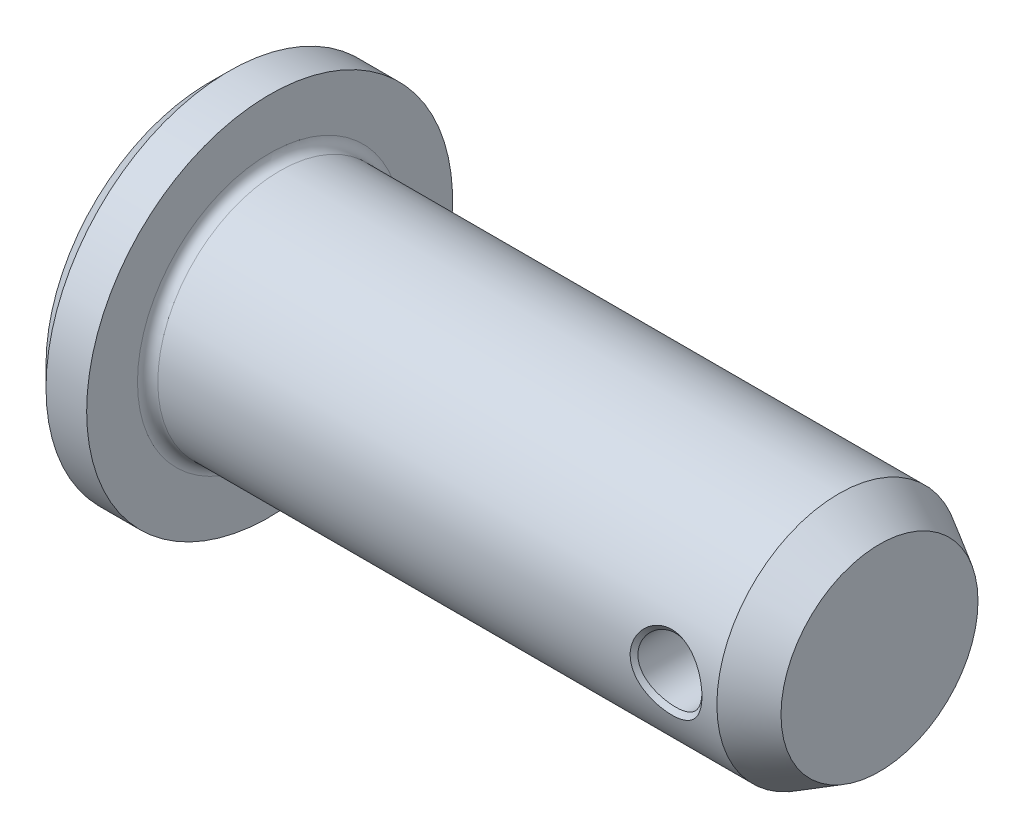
ISO-10303-21;
HEADER;
FILE_DESCRIPTION(('STEP AP214'),'2;1');
FILE_NAME('part.step','',(''),(''),'','','');
FILE_SCHEMA(('AUTOMOTIVE_DESIGN { 1 0 10303 214 1 1 1 1 }'));
ENDSEC;
DATA;
#1=APPLICATION_CONTEXT('core data for automotive mechanical design processes');
#2=APPLICATION_PROTOCOL_DEFINITION('international standard','automotive_design',2000,#1);
#3=PRODUCT_CONTEXT('',#1,'mechanical');
#4=PRODUCT('Part','Part','',(#3));
#5=PRODUCT_RELATED_PRODUCT_CATEGORY('part','',(#4));
#6=PRODUCT_DEFINITION_FORMATION('','',#4);
#7=PRODUCT_DEFINITION_CONTEXT('part definition',#1,'design');
#8=PRODUCT_DEFINITION('design','',#6,#7);
#9=PRODUCT_DEFINITION_SHAPE('','',#8);
#10=(LENGTH_UNIT() NAMED_UNIT(*) SI_UNIT(.MILLI.,.METRE.));
#11=(NAMED_UNIT(*) PLANE_ANGLE_UNIT() SI_UNIT($,.RADIAN.));
#12=(NAMED_UNIT(*) SI_UNIT($,.STERADIAN.) SOLID_ANGLE_UNIT());
#13=UNCERTAINTY_MEASURE_WITH_UNIT(LENGTH_MEASURE(1.E-05),#10,'distance_accuracy_value','');
#14=(GEOMETRIC_REPRESENTATION_CONTEXT(3) GLOBAL_UNCERTAINTY_ASSIGNED_CONTEXT((#13)) GLOBAL_UNIT_ASSIGNED_CONTEXT((#10,
#11,#12)) REPRESENTATION_CONTEXT('',''));
#15=CARTESIAN_POINT('',(0.,0.,0.));
#16=DIRECTION('',(0.,0.,1.));
#17=DIRECTION('',(1.,0.,0.));
#18=AXIS2_PLACEMENT_3D('',#15,#16,#17);
#19=CARTESIAN_POINT('',(0.,0.,0.));
#20=DIRECTION('',(-1.,0.,0.));
#21=DIRECTION('',(0.,0.,1.));
#22=AXIS2_PLACEMENT_3D('',#19,#20,#21);
#23=PLANE('',#22);
#24=CARTESIAN_POINT('',(0.,0.,0.));
#25=DIRECTION('',(-1.,0.,0.));
#26=DIRECTION('',(0.,0.,1.));
#27=AXIS2_PLACEMENT_3D('',#24,#25,#26);
#28=CIRCLE('',#27,16.);
#29=CARTESIAN_POINT('',(0.,0.,16.));
#30=VERTEX_POINT('',#29);
#31=EDGE_CURVE('E58',#30,#30,#28,.T.);
#32=ORIENTED_EDGE('',*,*,#31,.T.);
#33=EDGE_LOOP('',(#32));
#34=FACE_BOUND('',#33,.T.);
#35=ADVANCED_FACE('F31',(#34),#23,.T.);
#36=CARTESIAN_POINT('',(0.,0.,0.));
#37=DIRECTION('',(1.,0.,0.));
#38=DIRECTION('',(0.,0.,-1.));
#39=AXIS2_PLACEMENT_3D('',#36,#37,#38);
#40=CONICAL_SURFACE('',#39,16.,0.78539816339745);
#41=CARTESIAN_POINT('',(2.,0.,0.));
#42=DIRECTION('',(-1.,0.,0.));
#43=DIRECTION('',(0.,0.,1.));
#44=AXIS2_PLACEMENT_3D('',#41,#42,#43);
#45=CIRCLE('',#44,18.);
#46=CARTESIAN_POINT('',(2.,0.,18.));
#47=VERTEX_POINT('',#46);
#48=EDGE_CURVE('E63',#47,#47,#45,.T.);
#49=ORIENTED_EDGE('',*,*,#48,.T.);
#50=EDGE_LOOP('',(#49));
#51=FACE_BOUND('',#50,.T.);
#52=ORIENTED_EDGE('',*,*,#31,.F.);
#53=EDGE_LOOP('',(#52));
#54=FACE_BOUND('',#53,.T.);
#55=ADVANCED_FACE('F168',(#51,#54),#40,.T.);
#56=CARTESIAN_POINT('',(0.,0.,0.));
#57=DIRECTION('',(-1.,0.,0.));
#58=DIRECTION('',(0.,0.,1.));
#59=AXIS2_PLACEMENT_3D('',#56,#57,#58);
#60=CYLINDRICAL_SURFACE('',#59,18.);
#61=CARTESIAN_POINT('',(6.,0.,0.));
#62=DIRECTION('',(-1.,0.,0.));
#63=DIRECTION('',(0.,0.,1.));
#64=AXIS2_PLACEMENT_3D('',#61,#62,#63);
#65=CIRCLE('',#64,18.);
#66=CARTESIAN_POINT('',(6.,0.,18.));
#67=VERTEX_POINT('',#66);
#68=EDGE_CURVE('E68',#67,#67,#65,.T.);
#69=ORIENTED_EDGE('',*,*,#68,.T.);
#70=EDGE_LOOP('',(#69));
#71=FACE_BOUND('',#70,.T.);
#72=ORIENTED_EDGE('',*,*,#48,.F.);
#73=EDGE_LOOP('',(#72));
#74=FACE_BOUND('',#73,.T.);
#75=ADVANCED_FACE('F172',(#71,#74),#60,.T.);
#76=CARTESIAN_POINT('',(6.,18.,0.));
#77=DIRECTION('',(1.,0.,0.));
#78=DIRECTION('',(0.,0.,-1.));
#79=AXIS2_PLACEMENT_3D('',#76,#77,#78);
#80=PLANE('',#79);
#81=CARTESIAN_POINT('',(6.,0.,0.));
#82=DIRECTION('',(-1.,0.,0.));
#83=DIRECTION('',(0.,0.,1.));
#84=AXIS2_PLACEMENT_3D('',#81,#82,#83);
#85=CIRCLE('',#84,13.);
#86=CARTESIAN_POINT('',(6.,0.,13.));
#87=VERTEX_POINT('',#86);
#88=EDGE_CURVE('E190',#87,#87,#85,.T.);
#89=ORIENTED_EDGE('',*,*,#88,.T.);
#90=EDGE_LOOP('',(#89));
#91=FACE_BOUND('',#90,.T.);
#92=ORIENTED_EDGE('',*,*,#68,.F.);
#93=EDGE_LOOP('',(#92));
#94=FACE_BOUND('',#93,.T.);
#95=ADVANCED_FACE('F177',(#91,#94),#80,.T.);
#96=CARTESIAN_POINT('',(7.,0.,0.));
#97=DIRECTION('',(-1.,0.,0.));
#98=DIRECTION('',(0.,0.,1.));
#99=AXIS2_PLACEMENT_3D('',#96,#97,#98);
#100=TOROIDAL_SURFACE('',#99,13.,0.999999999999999);
#101=ORIENTED_EDGE('',*,*,#88,.F.);
#102=EDGE_LOOP('',(#101));
#103=FACE_BOUND('',#102,.T.);
#104=CARTESIAN_POINT('',(7.,0.,0.));
#105=DIRECTION('',(-1.,0.,0.));
#106=DIRECTION('',(0.,0.,1.));
#107=AXIS2_PLACEMENT_3D('',#104,#105,#106);
#108=CIRCLE('',#107,12.);
#109=CARTESIAN_POINT('',(7.,0.,12.));
#110=VERTEX_POINT('',#109);
#111=EDGE_CURVE('E193',#110,#110,#108,.T.);
#112=ORIENTED_EDGE('',*,*,#111,.T.);
#113=EDGE_LOOP('',(#112));
#114=FACE_BOUND('',#113,.T.);
#115=ADVANCED_FACE('F111',(#103,#114),#100,.F.);
#116=CARTESIAN_POINT('',(0.,0.,0.));
#117=DIRECTION('',(-1.,0.,0.));
#118=DIRECTION('',(0.,0.,1.));
#119=AXIS2_PLACEMENT_3D('',#116,#117,#118);
#120=CYLINDRICAL_SURFACE('',#119,12.);
#121=CARTESIAN_POINT('',(60.5309999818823,0.,12.));
#122=CARTESIAN_POINT('',(60.53059480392,0.963675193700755,11.9998958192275));
#123=CARTESIAN_POINT('',(60.1454326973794,1.90775318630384,11.8698914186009));
#124=CARTESIAN_POINT('',(58.8475713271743,3.25018331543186,11.5692999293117));
#125=CARTESIAN_POINT('',(57.9332355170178,3.64750594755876,11.432267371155));
#126=CARTESIAN_POINT('',(56.0681782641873,3.64606472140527,11.4326364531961));
#127=CARTESIAN_POINT('',(55.154420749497,3.25044613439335,11.5691885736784));
#128=CARTESIAN_POINT('',(53.8531985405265,1.90813389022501,11.8698611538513));
#129=CARTESIAN_POINT('',(53.4691044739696,0.964998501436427,11.9999888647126));
#130=CARTESIAN_POINT('',(53.4688955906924,-0.965652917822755,12.0000111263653));
#131=CARTESIAN_POINT('',(53.8524932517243,-1.90694169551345,11.8700886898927));
#132=CARTESIAN_POINT('',(55.1531008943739,-3.24954694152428,11.5694212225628));
#133=CARTESIAN_POINT('',(56.0691807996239,-3.64667685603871,11.4324385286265));
#134=CARTESIAN_POINT('',(57.9350177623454,-3.64689267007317,11.4324656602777));
#135=CARTESIAN_POINT('',(58.8467380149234,-3.25006313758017,11.5692062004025));
#136=CARTESIAN_POINT('',(60.1452542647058,-1.90891782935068,11.8697552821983));
#137=CARTESIAN_POINT('',(60.5314051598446,-0.963675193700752,12.0001041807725));
#138=CARTESIAN_POINT('',(60.5309999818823,0.,12.));
#139=B_SPLINE_CURVE_WITH_KNOTS('',3,(#121,#122,#123,#124,#125,#126,#127,#128,#129,#130,#131,
#132,#133,#134,#135,#136,#137,#138),.UNSPECIFIED.,.T.,.F.,(4,2,2,2,2,2,2,2,4),
(-0.0221963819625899,-0.0194195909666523,-0.0166427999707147,-0.0138660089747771,
-0.0110892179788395,-0.00831242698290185,-0.00553563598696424,-0.00275884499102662,
1.79460049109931E-05),.UNSPECIFIED.);
#140=CARTESIAN_POINT('',(60.5309999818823,0.,12.));
#141=VERTEX_POINT('',#140);
#142=EDGE_CURVE('E10',#141,#141,#139,.F.);
#143=ORIENTED_EDGE('',*,*,#142,.T.);
#144=EDGE_LOOP('',(#143));
#145=FACE_BOUND('',#144,.T.);
#146=CARTESIAN_POINT('',(60.5309999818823,0.,-12.));
#147=CARTESIAN_POINT('',(60.53059480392,-0.963675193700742,-11.9998958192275));
#148=CARTESIAN_POINT('',(60.1454326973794,-1.90775318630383,-11.8698914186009));
#149=CARTESIAN_POINT('',(58.8475713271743,-3.25018331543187,-11.5692999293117));
#150=CARTESIAN_POINT('',(57.9332355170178,-3.64750594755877,-11.432267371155));
#151=CARTESIAN_POINT('',(56.0681782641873,-3.64606472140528,-11.4326364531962));
#152=CARTESIAN_POINT('',(55.154420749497,-3.25044613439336,-11.5691885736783));
#153=CARTESIAN_POINT('',(53.8531985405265,-1.90813389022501,-11.8698611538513));
#154=CARTESIAN_POINT('',(53.4691044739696,-0.964998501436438,-11.9999888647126));
#155=CARTESIAN_POINT('',(53.4688955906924,0.965652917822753,-12.0000111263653));
#156=CARTESIAN_POINT('',(53.8524932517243,1.90694169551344,-11.8700886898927));
#157=CARTESIAN_POINT('',(55.1531008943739,3.24954694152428,-11.5694212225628));
#158=CARTESIAN_POINT('',(56.0691807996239,3.64667685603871,-11.4324385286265));
#159=CARTESIAN_POINT('',(57.9350177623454,3.64689267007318,-11.4324656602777));
#160=CARTESIAN_POINT('',(58.8467380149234,3.25006313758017,-11.5692062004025));
#161=CARTESIAN_POINT('',(60.1452542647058,1.90891782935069,-11.8697552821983));
#162=CARTESIAN_POINT('',(60.5314051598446,0.963675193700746,-12.0001041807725));
#163=CARTESIAN_POINT('',(60.5309999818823,0.,-12.));
#164=B_SPLINE_CURVE_WITH_KNOTS('',3,(#146,#147,#148,#149,#150,#151,#152,#153,#154,#155,#156,
#157,#158,#159,#160,#161,#162,#163),.UNSPECIFIED.,.T.,.F.,(4,2,2,2,2,2,2,2,4),
(-0.0221963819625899,-0.0194195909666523,-0.0166427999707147,-0.0138660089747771,
-0.0110892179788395,-0.00831242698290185,-0.00553563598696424,-0.00275884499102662,
1.79460049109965E-05),.UNSPECIFIED.);
#165=CARTESIAN_POINT('',(60.5309999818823,0.,-12.));
#166=VERTEX_POINT('',#165);
#167=EDGE_CURVE('E43',#166,#166,#164,.F.);
#168=ORIENTED_EDGE('',*,*,#167,.T.);
#169=EDGE_LOOP('',(#168));
#170=FACE_BOUND('',#169,.T.);
#171=CARTESIAN_POINT('',(62.,0.,0.));
#172=DIRECTION('',(-1.,0.,0.));
#173=DIRECTION('',(0.,0.,1.));
#174=AXIS2_PLACEMENT_3D('',#171,#172,#173);
#175=CIRCLE('',#174,12.);
#176=CARTESIAN_POINT('',(62.,0.,12.));
#177=VERTEX_POINT('',#176);
#178=EDGE_CURVE('E198',#177,#177,#175,.T.);
#179=ORIENTED_EDGE('',*,*,#178,.T.);
#180=EDGE_LOOP('',(#179));
#181=FACE_BOUND('',#180,.T.);
#182=ORIENTED_EDGE('',*,*,#111,.F.);
#183=EDGE_LOOP('',(#182));
#184=FACE_BOUND('',#183,.T.);
#185=ADVANCED_FACE('F101',(#145,#170,#181,#184),#120,.T.);
#186=CARTESIAN_POINT('',(62.,0.,0.));
#187=DIRECTION('',(-1.,0.,0.));
#188=DIRECTION('',(0.,0.,1.));
#189=AXIS2_PLACEMENT_3D('',#186,#187,#188);
#190=CONICAL_SURFACE('',#189,12.,0.5235987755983);
#191=CARTESIAN_POINT('',(66.,0.,0.));
#192=DIRECTION('',(-1.,0.,0.));
#193=DIRECTION('',(0.,0.,1.));
#194=AXIS2_PLACEMENT_3D('',#191,#192,#193);
#195=CIRCLE('',#194,9.69059892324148);
#196=CARTESIAN_POINT('',(66.,0.,9.69059892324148));
#197=VERTEX_POINT('',#196);
#198=EDGE_CURVE('E201',#197,#197,#195,.T.);
#199=ORIENTED_EDGE('',*,*,#198,.T.);
#200=EDGE_LOOP('',(#199));
#201=FACE_BOUND('',#200,.T.);
#202=ORIENTED_EDGE('',*,*,#178,.F.);
#203=EDGE_LOOP('',(#202));
#204=FACE_BOUND('',#203,.T.);
#205=ADVANCED_FACE('F110',(#201,#204),#190,.T.);
#206=CARTESIAN_POINT('',(66.,9.69059892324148,0.));
#207=DIRECTION('',(1.,0.,0.));
#208=DIRECTION('',(0.,0.,-1.));
#209=AXIS2_PLACEMENT_3D('',#206,#207,#208);
#210=PLANE('',#209);
#211=ORIENTED_EDGE('',*,*,#198,.F.);
#212=EDGE_LOOP('',(#211));
#213=FACE_BOUND('',#212,.T.);
#214=ADVANCED_FACE('F86',(#213),#210,.T.);
#215=CARTESIAN_POINT('',(57.,0.,-12.));
#216=DIRECTION('',(0.,0.,1.));
#217=DIRECTION('',(1.,0.,0.));
#218=AXIS2_PLACEMENT_3D('',#215,#216,#217);
#219=CYLINDRICAL_SURFACE('',#218,3.15);
#220=CARTESIAN_POINT('',(60.15,0.,11.6190000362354));
#221=CARTESIAN_POINT('',(60.1500240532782,-0.0519717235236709,11.6190069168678));
#222=CARTESIAN_POINT('',(60.1487009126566,-0.10394099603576,11.6185202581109));
#223=CARTESIAN_POINT('',(60.143410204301,-0.207646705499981,11.616610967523));
#224=CARTESIAN_POINT('',(60.13944676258,-0.259383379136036,11.6151897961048));
#225=CARTESIAN_POINT('',(60.128929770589,-0.362514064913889,11.611463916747));
#226=CARTESIAN_POINT('',(60.1223784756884,-0.413908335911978,11.6091599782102));
#227=CARTESIAN_POINT('',(60.1067417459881,-0.516246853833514,11.6037216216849));
#228=CARTESIAN_POINT('',(60.0976571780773,-0.56719124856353,11.6005874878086));
#229=CARTESIAN_POINT('',(60.0770088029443,-0.668522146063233,11.5935413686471));
#230=CARTESIAN_POINT('',(60.0654448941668,-0.718908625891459,11.5896293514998));
#231=CARTESIAN_POINT('',(60.0398924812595,-0.819016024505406,11.5810799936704));
#232=CARTESIAN_POINT('',(60.0259032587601,-0.868736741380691,11.5764424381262));
#233=CARTESIAN_POINT('',(59.9955544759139,-0.967404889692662,11.5664943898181));
#234=CARTESIAN_POINT('',(59.9791938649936,-1.01635196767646,11.5611835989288));
#235=CARTESIAN_POINT('',(59.9441562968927,-1.11336508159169,11.5499413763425));
#236=CARTESIAN_POINT('',(59.9254781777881,-1.16143066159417,11.5440096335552));
#237=CARTESIAN_POINT('',(59.8858593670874,-1.25657295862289,11.5315777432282));
#238=CARTESIAN_POINT('',(59.8649175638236,-1.30364917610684,11.5250773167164));
#239=CARTESIAN_POINT('',(59.8208250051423,-1.39670485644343,11.5115602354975));
#240=CARTESIAN_POINT('',(59.797673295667,-1.44268383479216,11.5045433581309));
#241=CARTESIAN_POINT('',(59.7492144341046,-1.53343708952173,11.4900456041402));
#242=CARTESIAN_POINT('',(59.7239065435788,-1.57821094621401,11.4825645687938));
#243=CARTESIAN_POINT('',(59.6711888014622,-1.66644591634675,11.4671904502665));
#244=CARTESIAN_POINT('',(59.6437784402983,-1.709906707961,11.4592972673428));
#245=CARTESIAN_POINT('',(59.5869091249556,-1.79540761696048,11.4431518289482));
#246=CARTESIAN_POINT('',(59.5574498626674,-1.83744751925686,11.4348995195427));
#247=CARTESIAN_POINT('',(59.496536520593,-1.91999816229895,11.4180850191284));
#248=CARTESIAN_POINT('',(59.4650822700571,-1.96050877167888,11.4095228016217));
#249=CARTESIAN_POINT('',(59.4002313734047,-2.03989440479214,11.3921518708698));
#250=CARTESIAN_POINT('',(59.3668345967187,-2.07876931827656,11.3833431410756));
#251=CARTESIAN_POINT('',(59.2981564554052,-2.15476958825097,11.3654896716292));
#252=CARTESIAN_POINT('',(59.2628748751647,-2.19189474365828,11.3564449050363));
#253=CARTESIAN_POINT('',(59.1904803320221,-2.26429503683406,11.3383311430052));
#254=CARTESIAN_POINT('',(59.1533676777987,-2.29957048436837,11.3292621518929));
#255=CARTESIAN_POINT('',(59.077414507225,-2.36822547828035,11.3113178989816));
#256=CARTESIAN_POINT('',(59.0385747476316,-2.4016058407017,11.3024425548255));
#257=CARTESIAN_POINT('',(58.9592768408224,-2.46641301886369,11.2849020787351));
#258=CARTESIAN_POINT('',(58.9188192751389,-2.4978405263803,11.2762368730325));
#259=CARTESIAN_POINT('',(58.8363897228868,-2.55869184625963,11.259186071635));
#260=CARTESIAN_POINT('',(58.7944182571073,-2.5881163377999,11.2508003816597));
#261=CARTESIAN_POINT('',(58.709066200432,-2.64490931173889,11.2343638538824));
#262=CARTESIAN_POINT('',(58.6656861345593,-2.67227854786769,11.2263128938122));
#263=CARTESIAN_POINT('',(58.5776217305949,-2.72490915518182,11.2106048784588));
#264=CARTESIAN_POINT('',(58.532937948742,-2.75017140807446,11.2029476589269));
#265=CARTESIAN_POINT('',(58.4423710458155,-2.79853599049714,11.1880851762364));
#266=CARTESIAN_POINT('',(58.3964885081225,-2.82163934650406,11.1808796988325));
#267=CARTESIAN_POINT('',(58.3036290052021,-2.86563409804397,11.1669790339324));
#268=CARTESIAN_POINT('',(58.2566526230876,-2.88652664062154,11.1602835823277));
#269=CARTESIAN_POINT('',(58.1617103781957,-2.92604774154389,11.1474612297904));
#270=CARTESIAN_POINT('',(58.1137450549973,-2.94467749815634,11.1413340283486));
#271=CARTESIAN_POINT('',(58.0169299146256,-2.97962107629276,11.1297064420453));
#272=CARTESIAN_POINT('',(57.9680805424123,-2.99593602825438,11.1242057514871));
#273=CARTESIAN_POINT('',(57.8696023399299,-3.02619816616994,11.1138894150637));
#274=CARTESIAN_POINT('',(57.819973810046,-3.04014624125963,11.1090735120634));
#275=CARTESIAN_POINT('',(57.7200423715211,-3.06562297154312,11.1001849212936));
#276=CARTESIAN_POINT('',(57.6697395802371,-3.0771520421,11.0961121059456));
#277=CARTESIAN_POINT('',(57.56856473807,-3.09773934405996,11.0887677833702));
#278=CARTESIAN_POINT('',(57.5176926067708,-3.10679722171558,11.0854963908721));
#279=CARTESIAN_POINT('',(57.4154841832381,-3.12239102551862,11.0798128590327));
#280=CARTESIAN_POINT('',(57.3641476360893,-3.12892546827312,11.0774012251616));
#281=CARTESIAN_POINT('',(57.261115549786,-3.13942163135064,11.0734951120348));
#282=CARTESIAN_POINT('',(57.2094196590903,-3.14338031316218,11.0720017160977));
#283=CARTESIAN_POINT('',(57.1057735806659,-3.14867470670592,11.0699893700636));
#284=CARTESIAN_POINT('',(57.0538230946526,-3.15000533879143,11.0694723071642));
#285=CARTESIAN_POINT('',(56.9499075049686,-3.14999354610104,11.0694712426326));
#286=CARTESIAN_POINT('',(56.8979424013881,-3.14865035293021,11.0699875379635));
#287=CARTESIAN_POINT('',(56.7942400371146,-3.14333151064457,11.0720001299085));
#288=CARTESIAN_POINT('',(56.7425025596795,-3.13935953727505,11.0734950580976));
#289=CARTESIAN_POINT('',(56.6393634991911,-3.12883730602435,11.0774052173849));
#290=CARTESIAN_POINT('',(56.5879617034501,-3.12228888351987,11.0798197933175));
#291=CARTESIAN_POINT('',(56.485602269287,-3.1066672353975,11.0855102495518));
#292=CARTESIAN_POINT('',(56.4346445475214,-3.0975944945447,11.0887859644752));
#293=CARTESIAN_POINT('',(56.3332813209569,-3.07697724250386,11.0961397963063));
#294=CARTESIAN_POINT('',(56.2828759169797,-3.06543228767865,11.1002180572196));
#295=CARTESIAN_POINT('',(56.1827253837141,-3.03992321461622,11.1091182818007));
#296=CARTESIAN_POINT('',(56.1329805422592,-3.02595807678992,11.1139405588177));
#297=CARTESIAN_POINT('',(56.0342592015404,-2.99566090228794,11.1242702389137));
#298=CARTESIAN_POINT('',(55.985283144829,-2.97932755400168,11.1297780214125));
#299=CARTESIAN_POINT('',(55.8882074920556,-2.94434594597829,11.1414202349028));
#300=CARTESIAN_POINT('',(55.8401084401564,-2.92569630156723,11.1475550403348));
#301=CARTESIAN_POINT('',(55.7448949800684,-2.88613387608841,11.1603928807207));
#302=CARTESIAN_POINT('',(55.6977811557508,-2.86521979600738,11.1670962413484));
#303=CARTESIAN_POINT('',(55.6046464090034,-2.82118012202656,11.1810128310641));
#304=CARTESIAN_POINT('',(55.5586260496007,-2.79805341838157,11.1882263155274));
#305=CARTESIAN_POINT('',(55.4677865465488,-2.74964001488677,11.20310473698));
#306=CARTESIAN_POINT('',(55.422967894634,-2.72435244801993,11.2107698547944));
#307=CARTESIAN_POINT('',(55.3346402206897,-2.67166880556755,11.2264933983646));
#308=CARTESIAN_POINT('',(55.2911315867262,-2.64427211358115,11.2345519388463));
#309=CARTESIAN_POINT('',(55.2055322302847,-2.58742162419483,11.2510031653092));
#310=CARTESIAN_POINT('',(55.1634417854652,-2.55796742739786,11.2593959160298));
#311=CARTESIAN_POINT('',(55.0807877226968,-2.49705365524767,11.2764601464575));
#312=CARTESIAN_POINT('',(55.0402242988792,-2.46559382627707,11.2851316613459));
#313=CARTESIAN_POINT('',(54.9607308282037,-2.40071950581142,11.3026839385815));
#314=CARTESIAN_POINT('',(54.9218009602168,-2.36730480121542,11.3115647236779));
#315=CARTESIAN_POINT('',(54.8456898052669,-2.29857558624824,11.3295184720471));
#316=CARTESIAN_POINT('',(54.8085088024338,-2.26326076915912,11.3385914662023));
#317=CARTESIAN_POINT('',(54.7360015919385,-2.1907949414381,11.3567109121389));
#318=CARTESIAN_POINT('',(54.7006747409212,-2.15364457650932,11.3657573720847));
#319=CARTESIAN_POINT('',(54.631927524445,-2.07762192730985,11.3836112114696));
#320=CARTESIAN_POINT('',(54.5985056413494,-2.0387510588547,11.3924187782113));
#321=CARTESIAN_POINT('',(54.5336258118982,-1.95939470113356,11.4097844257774));
#322=CARTESIAN_POINT('',(54.5021665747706,-1.91891030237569,11.4183426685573));
#323=CARTESIAN_POINT('',(54.4412608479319,-1.83642990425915,11.4351468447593));
#324=CARTESIAN_POINT('',(54.411813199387,-1.79443479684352,11.4433929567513));
#325=CARTESIAN_POINT('',(54.3549819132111,-1.70903698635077,11.4595240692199));
#326=CARTESIAN_POINT('',(54.3275971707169,-1.66563505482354,11.4674092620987));
#327=CARTESIAN_POINT('',(54.2749424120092,-1.57752723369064,11.4827659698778));
#328=CARTESIAN_POINT('',(54.2496712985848,-1.53282203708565,11.4902376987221));
#329=CARTESIAN_POINT('',(54.2012947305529,-1.4422113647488,11.5047159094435));
#330=CARTESIAN_POINT('',(54.1781881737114,-1.3963065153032,11.5117226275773));
#331=CARTESIAN_POINT('',(54.1341916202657,-1.30340018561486,11.5252189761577));
#332=CARTESIAN_POINT('',(54.1133005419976,-1.25639925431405,11.5317088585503));
#333=CARTESIAN_POINT('',(54.0737858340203,-1.16140442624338,11.5441197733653));
#334=CARTESIAN_POINT('',(54.0551612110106,-1.11341097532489,11.550041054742));
#335=CARTESIAN_POINT('',(54.0202302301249,-1.01653479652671,11.5612630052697));
#336=CARTESIAN_POINT('',(54.0039230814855,-0.96765237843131,11.566563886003));
#337=CARTESIAN_POINT('',(53.9736777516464,-0.869101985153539,11.5764933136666));
#338=CARTESIAN_POINT('',(53.9597391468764,-0.81943415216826,11.5811219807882));
#339=CARTESIAN_POINT('',(53.9342814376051,-0.719416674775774,11.5896553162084));
#340=CARTESIAN_POINT('',(53.9227624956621,-0.669066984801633,11.5935599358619));
#341=CARTESIAN_POINT('',(53.9021944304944,-0.56778956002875,11.6005935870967));
#342=CARTESIAN_POINT('',(53.8931463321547,-0.516861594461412,11.6037222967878));
#343=CARTESIAN_POINT('',(53.877569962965,-0.414531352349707,11.6091526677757));
#344=CARTESIAN_POINT('',(53.8710439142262,-0.363128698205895,11.6114535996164));
#345=CARTESIAN_POINT('',(53.8605614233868,-0.259952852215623,11.6151770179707));
#346=CARTESIAN_POINT('',(53.8566087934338,-0.208179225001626,11.6165982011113));
#347=CARTESIAN_POINT('',(53.8513221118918,-0.104364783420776,11.6185111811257));
#348=CARTESIAN_POINT('',(53.8499939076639,-0.0523236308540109,11.6190009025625));
#349=CARTESIAN_POINT('',(53.8500061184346,0.0517646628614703,11.618999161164));
#350=CARTESIAN_POINT('',(53.8513468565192,0.103811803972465,11.6185075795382));
#351=CARTESIAN_POINT('',(53.8566602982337,0.207649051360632,11.6165895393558));
#352=CARTESIAN_POINT('',(53.8606277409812,0.259439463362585,11.6151649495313));
#353=CARTESIAN_POINT('',(53.8711407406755,0.362658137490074,11.6114339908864));
#354=CARTESIAN_POINT('',(53.8776829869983,0.414086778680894,11.6091287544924));
#355=CARTESIAN_POINT('',(53.8932926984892,0.516476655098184,11.6036890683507));
#356=CARTESIAN_POINT('',(53.9023583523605,0.567438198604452,11.600555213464));
#357=CARTESIAN_POINT('',(53.9229623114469,0.668788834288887,11.5935107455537));
#358=CARTESIAN_POINT('',(53.9344999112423,0.719178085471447,11.5896003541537));
#359=CARTESIAN_POINT('',(53.9599956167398,0.819279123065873,11.5810550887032));
#360=CARTESIAN_POINT('',(53.9739537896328,0.868990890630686,11.5764201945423));
#361=CARTESIAN_POINT('',(54.0042388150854,0.967631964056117,11.5664780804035));
#362=CARTESIAN_POINT('',(54.0205662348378,1.01656107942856,11.5611706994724));
#363=CARTESIAN_POINT('',(54.0555381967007,1.11353182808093,11.5499356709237));
#364=CARTESIAN_POINT('',(54.074183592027,1.16157312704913,11.5440077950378));
#365=CARTESIAN_POINT('',(54.1137401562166,1.25666318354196,11.5315837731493));
#366=CARTESIAN_POINT('',(54.1346523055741,1.30371150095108,11.5250873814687));
#367=CARTESIAN_POINT('',(54.1786911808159,1.39671048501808,11.5115782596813));
#368=CARTESIAN_POINT('',(54.2018189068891,1.44266064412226,11.5045652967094));
#369=CARTESIAN_POINT('',(54.2502378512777,1.53335816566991,11.4900750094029));
#370=CARTESIAN_POINT('',(54.2755300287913,1.57810498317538,11.4825974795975));
#371=CARTESIAN_POINT('',(54.3282268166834,1.66629060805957,11.4672297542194));
#372=CARTESIAN_POINT('',(54.3556323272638,1.7097288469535,11.4593393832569));
#373=CARTESIAN_POINT('',(54.4125048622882,1.79519220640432,11.4431986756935));
#374=CARTESIAN_POINT('',(54.4419727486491,1.83721672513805,11.4349481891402));
#375=CARTESIAN_POINT('',(54.5029186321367,1.91974708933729,11.4181361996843));
#376=CARTESIAN_POINT('',(54.5343975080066,1.96025225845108,11.409574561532));
#377=CARTESIAN_POINT('',(54.5993156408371,2.03964011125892,11.3922032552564));
#378=CARTESIAN_POINT('',(54.6327558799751,2.07852196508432,11.383393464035));
#379=CARTESIAN_POINT('',(54.7015404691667,2.15455310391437,11.3655364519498));
#380=CARTESIAN_POINT('',(54.7368860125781,2.19170127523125,11.3564890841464));
#381=CARTESIAN_POINT('',(54.8094213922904,2.26415130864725,11.3383701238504));
#382=CARTESIAN_POINT('',(54.8466113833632,2.29945301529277,11.3292985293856));
#383=CARTESIAN_POINT('',(54.9227234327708,2.36814907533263,11.3113504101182));
#384=CARTESIAN_POINT('',(54.961644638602,2.40154434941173,11.3024737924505));
#385=CARTESIAN_POINT('',(55.0411073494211,2.46637256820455,11.2849321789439));
#386=CARTESIAN_POINT('',(55.081648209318,2.49780628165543,11.2762671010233));
#387=CARTESIAN_POINT('',(55.1642451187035,2.55866260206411,11.2592175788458));
#388=CARTESIAN_POINT('',(55.2063006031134,2.58808594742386,11.2508330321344));
#389=CARTESIAN_POINT('',(55.2918200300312,2.64487092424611,11.2343995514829));
#390=CARTESIAN_POINT('',(55.3352834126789,2.67223336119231,11.2263504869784));
#391=CARTESIAN_POINT('',(55.4235124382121,2.72484626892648,11.2106467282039));
#392=CARTESIAN_POINT('',(55.468277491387,2.75009767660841,11.2029918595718));
#393=CARTESIAN_POINT('',(55.5590035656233,2.79843808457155,11.1881342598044));
#394=CARTESIAN_POINT('',(55.6049639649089,2.8215281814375,11.1809313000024));
#395=CARTESIAN_POINT('',(55.6979744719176,2.86549552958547,11.1670355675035));
#396=CARTESIAN_POINT('',(55.7450239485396,2.8863740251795,11.1603425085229));
#397=CARTESIAN_POINT('',(55.8401063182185,2.92586773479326,11.1475245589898));
#398=CARTESIAN_POINT('',(55.8881386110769,2.94448428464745,11.1413993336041));
#399=CARTESIAN_POINT('',(55.9850802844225,2.97940372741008,11.1297750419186));
#400=CARTESIAN_POINT('',(56.0339891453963,2.99570794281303,11.1242756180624));
#401=CARTESIAN_POINT('',(56.1325775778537,3.02595244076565,11.1139608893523));
#402=CARTESIAN_POINT('',(56.1822567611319,3.03989387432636,11.1091452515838));
#403=CARTESIAN_POINT('',(56.2822794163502,3.06536271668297,11.1002559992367));
#404=CARTESIAN_POINT('',(56.3326226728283,3.07689088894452,11.0961821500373));
#405=CARTESIAN_POINT('',(56.4338670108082,3.09748325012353,11.088834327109));
#406=CARTESIAN_POINT('',(56.4847680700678,3.10654753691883,11.0855603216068));
#407=CARTESIAN_POINT('',(56.5870215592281,3.12216277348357,11.0798698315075));
#408=CARTESIAN_POINT('',(56.6383741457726,3.12871281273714,11.0774536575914));
#409=CARTESIAN_POINT('',(56.7414241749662,3.13924934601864,11.0735366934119));
#410=CARTESIAN_POINT('',(56.7931218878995,3.14323351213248,11.0720367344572));
#411=CARTESIAN_POINT('',(56.8967560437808,3.14859299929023,11.0700085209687));
#412=CARTESIAN_POINT('',(56.9486927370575,3.14996411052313,11.0694818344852));
#413=CARTESIAN_POINT('',(57.0525683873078,3.15003576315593,11.0694613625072));
#414=CARTESIAN_POINT('',(57.1045073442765,3.14873631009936,11.0699675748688));
#415=CARTESIAN_POINT('',(57.2081486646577,3.14349525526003,11.0719623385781));
#416=CARTESIAN_POINT('',(57.2598512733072,3.1395578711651,11.0734493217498));
#417=CARTESIAN_POINT('',(57.3629126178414,3.12909925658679,11.0773449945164));
#418=CARTESIAN_POINT('',(57.4142716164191,3.12258030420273,11.0797528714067));
#419=CARTESIAN_POINT('',(57.5165381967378,3.1070117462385,11.0854313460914));
#420=CARTESIAN_POINT('',(57.5674459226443,3.09796298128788,11.0887016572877));
#421=CARTESIAN_POINT('',(57.6687026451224,3.07738871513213,11.0960458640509));
#422=CARTESIAN_POINT('',(57.7190516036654,3.06586304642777,11.1001198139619));
#423=CARTESIAN_POINT('',(57.8190834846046,3.0403881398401,11.1090124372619));
#424=CARTESIAN_POINT('',(57.8687661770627,3.02643808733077,11.1138313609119));
#425=CARTESIAN_POINT('',(57.9673582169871,2.99616731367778,11.12415518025));
#426=CARTESIAN_POINT('',(58.0162671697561,2.9798454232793,11.1296604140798));
#427=CARTESIAN_POINT('',(58.113204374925,2.94488356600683,11.1412982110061));
#428=CARTESIAN_POINT('',(58.1612321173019,2.9262423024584,11.1474311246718));
#429=CARTESIAN_POINT('',(58.2562994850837,2.88669407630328,11.1602657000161));
#430=CARTESIAN_POINT('',(58.3033385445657,2.86578585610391,11.1669676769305));
#431=CARTESIAN_POINT('',(58.3963210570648,2.82175593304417,11.180881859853));
#432=CARTESIAN_POINT('',(58.4422639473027,2.79863312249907,11.1880943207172));
#433=CARTESIAN_POINT('',(58.532946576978,2.75022612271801,11.2029709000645));
#434=CARTESIAN_POINT('',(58.5776858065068,2.72494103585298,11.2106352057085));
#435=CARTESIAN_POINT('',(58.6658534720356,2.67226155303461,11.2263571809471));
#436=CARTESIAN_POINT('',(58.7092814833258,2.64486648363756,11.2344149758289));
#437=CARTESIAN_POINT('',(58.7947191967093,2.58801900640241,11.2508646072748));
#438=CARTESIAN_POINT('',(58.8367285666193,2.55856612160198,11.259256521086));
#439=CARTESIAN_POINT('',(58.9192208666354,2.49765533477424,11.2763188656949));
#440=CARTESIAN_POINT('',(58.9597035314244,2.46619708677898,11.2849893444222));
#441=CARTESIAN_POINT('',(59.0390365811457,2.40132675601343,11.3025390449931));
#442=CARTESIAN_POINT('',(59.0778867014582,2.36791435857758,11.3114183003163));
#443=CARTESIAN_POINT('',(59.1538404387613,2.29919150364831,11.3293688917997));
#444=CARTESIAN_POINT('',(59.1909436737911,2.26388063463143,11.3384402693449));
#445=CARTESIAN_POINT('',(59.2633065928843,2.19141448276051,11.3565564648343));
#446=CARTESIAN_POINT('',(59.2985663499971,2.15425927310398,11.3656012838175));
#447=CARTESIAN_POINT('',(59.3671989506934,2.07821138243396,11.3834523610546));
#448=CARTESIAN_POINT('',(59.4005723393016,2.03931920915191,11.3922586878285));
#449=CARTESIAN_POINT('',(59.4653731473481,1.95990794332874,11.4096229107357));
#450=CARTESIAN_POINT('',(59.4968009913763,1.91938920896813,11.4181808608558));
#451=CARTESIAN_POINT('',(59.5576599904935,1.83683065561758,11.4349853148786));
#452=CARTESIAN_POINT('',(59.5870915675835,1.79479116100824,11.4432318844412));
#453=CARTESIAN_POINT('',(59.6439049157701,1.70929803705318,11.4593647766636));
#454=CARTESIAN_POINT('',(59.6712871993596,1.66584476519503,11.4672511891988));
#455=CARTESIAN_POINT('',(59.7239493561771,1.57763064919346,11.4826111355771));
#456=CARTESIAN_POINT('',(59.7492298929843,1.53287022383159,11.4900847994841));
#457=CARTESIAN_POINT('',(59.7976357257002,1.44214842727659,11.504567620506));
#458=CARTESIAN_POINT('',(59.8207618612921,1.39618753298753,11.5115769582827));
#459=CARTESIAN_POINT('',(59.8648060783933,1.30317140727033,11.5250792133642));
#460=CARTESIAN_POINT('',(59.8857251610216,1.25611668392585,11.5315723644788));
#461=CARTESIAN_POINT('',(59.9253024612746,1.16101954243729,11.5439904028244));
#462=CARTESIAN_POINT('',(59.9439617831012,1.11297762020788,11.549915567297));
#463=CARTESIAN_POINT('',(59.9789668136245,1.01601276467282,11.5611457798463));
#464=CARTESIAN_POINT('',(59.9953136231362,0.967090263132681,11.5664511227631));
#465=CARTESIAN_POINT('',(60.0256409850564,0.86847097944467,11.5763898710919));
#466=CARTESIAN_POINT('',(60.0396224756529,0.818774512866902,11.5810235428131));
#467=CARTESIAN_POINT('',(60.065166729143,0.718714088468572,11.5895671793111));
#468=CARTESIAN_POINT('',(60.0767300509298,0.668350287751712,11.5934773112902));
#469=CARTESIAN_POINT('',(60.0973856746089,0.567061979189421,11.600522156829));
#470=CARTESIAN_POINT('',(60.1064778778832,0.516137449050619,11.6036568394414));
#471=CARTESIAN_POINT('',(60.1221394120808,0.413834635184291,11.6090992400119));
#472=CARTESIAN_POINT('',(60.1287076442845,0.362456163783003,11.6114065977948));
#473=CARTESIAN_POINT('',(60.1392691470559,0.259351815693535,11.6151427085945));
#474=CARTESIAN_POINT('',(60.14325991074,0.207625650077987,11.6165706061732));
#475=CARTESIAN_POINT('',(60.1486169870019,0.103934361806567,11.6184971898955));
#476=CARTESIAN_POINT('',(60.1499789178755,0.0519689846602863,11.6189943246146));
#477=CARTESIAN_POINT('',(60.15,0.,11.6190000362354));
#478=B_SPLINE_CURVE_WITH_KNOTS('',3,(#220,#221,#222,#223,#224,#225,#226,#227,#228,#229,#230,
#231,#232,#233,#234,#235,#236,#237,#238,#239,#240,#241,#242,#243,#244,#245,#246,#247,#248,#249,
#250,#251,#252,#253,#254,#255,#256,#257,#258,#259,#260,#261,#262,#263,#264,#265,#266,#267,#268,
#269,#270,#271,#272,#273,#274,#275,#276,#277,#278,#279,#280,#281,#282,#283,#284,#285,#286,#287,
#288,#289,#290,#291,#292,#293,#294,#295,#296,#297,#298,#299,#300,#301,#302,#303,#304,#305,#306,
#307,#308,#309,#310,#311,#312,#313,#314,#315,#316,#317,#318,#319,#320,#321,#322,#323,#324,#325,
#326,#327,#328,#329,#330,#331,#332,#333,#334,#335,#336,#337,#338,#339,#340,#341,#342,#343,#344,
#345,#346,#347,#348,#349,#350,#351,#352,#353,#354,#355,#356,#357,#358,#359,#360,#361,#362,#363,
#364,#365,#366,#367,#368,#369,#370,#371,#372,#373,#374,#375,#376,#377,#378,#379,#380,#381,#382,
#383,#384,#385,#386,#387,#388,#389,#390,#391,#392,#393,#394,#395,#396,#397,#398,#399,#400,#401,
#402,#403,#404,#405,#406,#407,#408,#409,#410,#411,#412,#413,#414,#415,#416,#417,#418,#419,#420,
#421,#422,#423,#424,#425,#426,#427,#428,#429,#430,#431,#432,#433,#434,#435,#436,#437,#438,#439,
#440,#441,#442,#443,#444,#445,#446,#447,#448,#449,#450,#451,#452,#453,#454,#455,#456,#457,#458,
#459,#460,#461,#462,#463,#464,#465,#466,#467,#468,#469,#470,#471,#472,#473,#474,#475,#476,#477),
.UNSPECIFIED.,.F.,.F.,(4,2,2,2,2,2,2,2,2,2,2,2,2,2,2,2,2,2,2,2,2,2,2,2,2,2,2,2,2,2,2,2,2,2,2,2,
2,2,2,2,2,2,2,2,2,2,2,2,2,2,2,2,2,2,2,2,2,2,2,2,2,2,2,2,2,2,2,2,2,2,2,2,2,2,2,2,2,2,2,2,2,2,2,2,
2,2,2,2,2,2,2,2,2,2,2,2,2,2,2,2,2,2,2,2,2,2,2,2,2,2,2,2,2,2,2,2,2,2,2,2,2,2,2,2,2,2,2,2,4),(0.,
0.155890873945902,0.311538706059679,0.467051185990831,0.622510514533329,0.777976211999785,
0.933488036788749,1.08906896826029,1.2447282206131,1.40046426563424,1.55626785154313,
1.71212501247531,1.86802006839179,2.02393861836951,2.17987053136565,2.33581293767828,
2.49177322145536,2.6477073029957,2.8035737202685,2.95938460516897,3.11514239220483,
3.27084277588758,3.42647767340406,3.58203819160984,3.73751759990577,3.89291431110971,
4.04823487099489,4.20349695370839,4.35873235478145,4.51398996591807,4.66933870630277,
4.82487037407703,4.98070236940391,5.13657915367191,5.29223843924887,5.44778703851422,
5.60330578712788,5.75885246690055,5.9144648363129,6.07016372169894,6.22595613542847,
6.38183839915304,6.5377992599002,6.6938229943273,6.84989250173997,7.00599238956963,
7.16211205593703,7.3182487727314,7.47441076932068,7.63051821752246,7.78649950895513,
7.94237711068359,8.09816414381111,8.2538671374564,8.40948879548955,8.56503077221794,
8.72049645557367,8.87589375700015,9.03123790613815,9.18655424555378,9.34188101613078,
9.49727211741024,9.65279981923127,9.80855739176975,9.96466161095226,10.1207847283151,
10.2765960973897,10.4322077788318,10.5877080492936,10.7431640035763,10.8986242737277,
11.0541218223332,11.2096767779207,11.3652992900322,11.5209923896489,11.6767548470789,
11.8325840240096,11.988478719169,12.1444420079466,12.3004840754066,12.4566250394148,
12.6127791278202,12.7688571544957,12.9248736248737,13.0808324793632,13.2367300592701,
13.3925580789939,13.5483066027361,13.7039670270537,13.8595350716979,14.0150137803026,
14.1704165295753,14.3257700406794,14.4811173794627,14.6365209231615,14.7920652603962,
14.9478599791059,15.1036543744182,15.2592002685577,15.4146092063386,15.5699665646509,
15.7253344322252,15.8807546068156,16.036251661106,16.1918360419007,16.3475071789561,
16.5032565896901,16.6590709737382,16.8149352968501,16.9708358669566,17.1267634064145,
17.2827161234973,17.4387027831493,17.5946832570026,17.750618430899,17.9065194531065,
18.0623874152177,18.2182162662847,18.3739957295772,18.5297142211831,18.6853617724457,
18.840932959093,18.9964298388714,19.1518648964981,19.3072639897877,19.4626692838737,
19.6181421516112,19.7737660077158,19.9296490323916),.UNSPECIFIED.);
#479=CARTESIAN_POINT('',(60.15,0.,11.6190000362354));
#480=VERTEX_POINT('',#479);
#481=EDGE_CURVE('E48',#480,#480,#478,.F.);
#482=ORIENTED_EDGE('',*,*,#481,.T.);
#483=EDGE_LOOP('',(#482));
#484=FACE_BOUND('',#483,.T.);
#485=CARTESIAN_POINT('',(60.15,0.,-11.6190000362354));
#486=CARTESIAN_POINT('',(60.1500240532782,0.0519717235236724,-11.6190069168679));
#487=CARTESIAN_POINT('',(60.1487009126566,0.103940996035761,-11.6185202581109));
#488=CARTESIAN_POINT('',(60.143410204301,0.207646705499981,-11.616610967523));
#489=CARTESIAN_POINT('',(60.13944676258,0.259383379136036,-11.6151897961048));
#490=CARTESIAN_POINT('',(60.128929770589,0.362514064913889,-11.611463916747));
#491=CARTESIAN_POINT('',(60.1223784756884,0.413908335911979,-11.6091599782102));
#492=CARTESIAN_POINT('',(60.1067417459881,0.516246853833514,-11.6037216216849));
#493=CARTESIAN_POINT('',(60.0976571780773,0.567191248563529,-11.6005874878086));
#494=CARTESIAN_POINT('',(60.0770088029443,0.668522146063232,-11.5935413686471));
#495=CARTESIAN_POINT('',(60.0654448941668,0.718908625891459,-11.5896293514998));
#496=CARTESIAN_POINT('',(60.0398924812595,0.819016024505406,-11.5810799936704));
#497=CARTESIAN_POINT('',(60.0259032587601,0.868736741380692,-11.5764424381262));
#498=CARTESIAN_POINT('',(59.9955544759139,0.967404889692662,-11.5664943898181));
#499=CARTESIAN_POINT('',(59.9791938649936,1.01635196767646,-11.5611835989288));
#500=CARTESIAN_POINT('',(59.9441562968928,1.11336508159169,-11.5499413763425));
#501=CARTESIAN_POINT('',(59.9254781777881,1.16143066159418,-11.5440096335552));
#502=CARTESIAN_POINT('',(59.8858593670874,1.2565729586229,-11.5315777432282));
#503=CARTESIAN_POINT('',(59.8649175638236,1.30364917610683,-11.5250773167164));
#504=CARTESIAN_POINT('',(59.8208250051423,1.39670485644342,-11.5115602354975));
#505=CARTESIAN_POINT('',(59.797673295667,1.44268383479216,-11.5045433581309));
#506=CARTESIAN_POINT('',(59.7492144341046,1.53343708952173,-11.4900456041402));
#507=CARTESIAN_POINT('',(59.7239065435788,1.57821094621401,-11.4825645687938));
#508=CARTESIAN_POINT('',(59.6711888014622,1.66644591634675,-11.4671904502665));
#509=CARTESIAN_POINT('',(59.6437784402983,1.709906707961,-11.4592972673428));
#510=CARTESIAN_POINT('',(59.5869091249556,1.79540761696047,-11.4431518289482));
#511=CARTESIAN_POINT('',(59.5574498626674,1.83744751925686,-11.4348995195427));
#512=CARTESIAN_POINT('',(59.496536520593,1.91999816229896,-11.4180850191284));
#513=CARTESIAN_POINT('',(59.4650822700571,1.96050877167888,-11.4095228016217));
#514=CARTESIAN_POINT('',(59.4002313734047,2.03989440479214,-11.3921518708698));
#515=CARTESIAN_POINT('',(59.3668345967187,2.07876931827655,-11.3833431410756));
#516=CARTESIAN_POINT('',(59.2981564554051,2.15476958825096,-11.3654896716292));
#517=CARTESIAN_POINT('',(59.2628748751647,2.19189474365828,-11.3564449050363));
#518=CARTESIAN_POINT('',(59.1904803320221,2.26429503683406,-11.3383311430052));
#519=CARTESIAN_POINT('',(59.1533676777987,2.29957048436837,-11.3292621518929));
#520=CARTESIAN_POINT('',(59.077414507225,2.36822547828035,-11.3113178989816));
#521=CARTESIAN_POINT('',(59.0385747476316,2.4016058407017,-11.3024425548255));
#522=CARTESIAN_POINT('',(58.9592768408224,2.46641301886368,-11.2849020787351));
#523=CARTESIAN_POINT('',(58.9188192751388,2.4978405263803,-11.2762368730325));
#524=CARTESIAN_POINT('',(58.8363897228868,2.55869184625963,-11.259186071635));
#525=CARTESIAN_POINT('',(58.7944182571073,2.5881163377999,-11.2508003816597));
#526=CARTESIAN_POINT('',(58.709066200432,2.6449093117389,-11.2343638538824));
#527=CARTESIAN_POINT('',(58.6656861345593,2.6722785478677,-11.2263128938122));
#528=CARTESIAN_POINT('',(58.5776217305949,2.72490915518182,-11.2106048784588));
#529=CARTESIAN_POINT('',(58.532937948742,2.75017140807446,-11.2029476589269));
#530=CARTESIAN_POINT('',(58.4423710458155,2.79853599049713,-11.1880851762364));
#531=CARTESIAN_POINT('',(58.3964885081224,2.82163934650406,-11.1808796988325));
#532=CARTESIAN_POINT('',(58.3036290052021,2.86563409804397,-11.1669790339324));
#533=CARTESIAN_POINT('',(58.2566526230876,2.88652664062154,-11.1602835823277));
#534=CARTESIAN_POINT('',(58.1617103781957,2.92604774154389,-11.1474612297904));
#535=CARTESIAN_POINT('',(58.1137450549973,2.94467749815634,-11.1413340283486));
#536=CARTESIAN_POINT('',(58.0169299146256,2.97962107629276,-11.1297064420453));
#537=CARTESIAN_POINT('',(57.9680805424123,2.99593602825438,-11.1242057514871));
#538=CARTESIAN_POINT('',(57.8696023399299,3.02619816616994,-11.1138894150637));
#539=CARTESIAN_POINT('',(57.819973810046,3.04014624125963,-11.1090735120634));
#540=CARTESIAN_POINT('',(57.7200423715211,3.06562297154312,-11.1001849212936));
#541=CARTESIAN_POINT('',(57.669739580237,3.0771520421,-11.0961121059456));
#542=CARTESIAN_POINT('',(57.56856473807,3.09773934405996,-11.0887677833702));
#543=CARTESIAN_POINT('',(57.5176926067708,3.10679722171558,-11.0854963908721));
#544=CARTESIAN_POINT('',(57.4154841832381,3.12239102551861,-11.0798128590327));
#545=CARTESIAN_POINT('',(57.3641476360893,3.12892546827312,-11.0774012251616));
#546=CARTESIAN_POINT('',(57.261115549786,3.13942163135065,-11.0734951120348));
#547=CARTESIAN_POINT('',(57.2094196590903,3.14338031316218,-11.0720017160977));
#548=CARTESIAN_POINT('',(57.1057735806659,3.14867470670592,-11.0699893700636));
#549=CARTESIAN_POINT('',(57.0538230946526,3.15000533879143,-11.0694723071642));
#550=CARTESIAN_POINT('',(56.9499075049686,3.14999354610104,-11.0694712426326));
#551=CARTESIAN_POINT('',(56.8979424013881,3.14865035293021,-11.0699875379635));
#552=CARTESIAN_POINT('',(56.7942400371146,3.14333151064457,-11.0720001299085));
#553=CARTESIAN_POINT('',(56.7425025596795,3.13935953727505,-11.0734950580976));
#554=CARTESIAN_POINT('',(56.6393634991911,3.12883730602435,-11.0774052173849));
#555=CARTESIAN_POINT('',(56.5879617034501,3.12228888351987,-11.0798197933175));
#556=CARTESIAN_POINT('',(56.4856022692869,3.1066672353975,-11.0855102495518));
#557=CARTESIAN_POINT('',(56.4346445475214,3.0975944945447,-11.0887859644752));
#558=CARTESIAN_POINT('',(56.3332813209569,3.07697724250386,-11.0961397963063));
#559=CARTESIAN_POINT('',(56.2828759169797,3.06543228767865,-11.1002180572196));
#560=CARTESIAN_POINT('',(56.1827253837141,3.03992321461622,-11.1091182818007));
#561=CARTESIAN_POINT('',(56.1329805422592,3.02595807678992,-11.1139405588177));
#562=CARTESIAN_POINT('',(56.0342592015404,2.99566090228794,-11.1242702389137));
#563=CARTESIAN_POINT('',(55.985283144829,2.97932755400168,-11.1297780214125));
#564=CARTESIAN_POINT('',(55.8882074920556,2.94434594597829,-11.1414202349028));
#565=CARTESIAN_POINT('',(55.8401084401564,2.92569630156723,-11.1475550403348));
#566=CARTESIAN_POINT('',(55.7448949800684,2.88613387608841,-11.1603928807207));
#567=CARTESIAN_POINT('',(55.6977811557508,2.86521979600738,-11.1670962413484));
#568=CARTESIAN_POINT('',(55.6046464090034,2.82118012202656,-11.1810128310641));
#569=CARTESIAN_POINT('',(55.5586260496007,2.79805341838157,-11.1882263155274));
#570=CARTESIAN_POINT('',(55.4677865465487,2.74964001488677,-11.20310473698));
#571=CARTESIAN_POINT('',(55.422967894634,2.72435244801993,-11.2107698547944));
#572=CARTESIAN_POINT('',(55.3346402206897,2.67166880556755,-11.2264933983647));
#573=CARTESIAN_POINT('',(55.2911315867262,2.64427211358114,-11.2345519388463));
#574=CARTESIAN_POINT('',(55.2055322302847,2.58742162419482,-11.2510031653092));
#575=CARTESIAN_POINT('',(55.1634417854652,2.55796742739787,-11.2593959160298));
#576=CARTESIAN_POINT('',(55.0807877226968,2.49705365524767,-11.2764601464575));
#577=CARTESIAN_POINT('',(55.0402242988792,2.46559382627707,-11.285131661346));
#578=CARTESIAN_POINT('',(54.9607308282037,2.40071950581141,-11.3026839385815));
#579=CARTESIAN_POINT('',(54.9218009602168,2.36730480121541,-11.3115647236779));
#580=CARTESIAN_POINT('',(54.8456898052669,2.29857558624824,-11.3295184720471));
#581=CARTESIAN_POINT('',(54.8085088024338,2.26326076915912,-11.3385914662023));
#582=CARTESIAN_POINT('',(54.7360015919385,2.1907949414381,-11.3567109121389));
#583=CARTESIAN_POINT('',(54.7006747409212,2.15364457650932,-11.3657573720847));
#584=CARTESIAN_POINT('',(54.631927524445,2.07762192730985,-11.3836112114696));
#585=CARTESIAN_POINT('',(54.5985056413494,2.03875105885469,-11.3924187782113));
#586=CARTESIAN_POINT('',(54.5336258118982,1.95939470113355,-11.4097844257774));
#587=CARTESIAN_POINT('',(54.5021665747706,1.91891030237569,-11.4183426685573));
#588=CARTESIAN_POINT('',(54.4412608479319,1.83642990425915,-11.4351468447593));
#589=CARTESIAN_POINT('',(54.4118131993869,1.79443479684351,-11.4433929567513));
#590=CARTESIAN_POINT('',(54.3549819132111,1.70903698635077,-11.4595240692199));
#591=CARTESIAN_POINT('',(54.3275971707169,1.66563505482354,-11.4674092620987));
#592=CARTESIAN_POINT('',(54.2749424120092,1.57752723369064,-11.4827659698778));
#593=CARTESIAN_POINT('',(54.2496712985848,1.53282203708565,-11.4902376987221));
#594=CARTESIAN_POINT('',(54.2012947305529,1.4422113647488,-11.5047159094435));
#595=CARTESIAN_POINT('',(54.1781881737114,1.39630651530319,-11.5117226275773));
#596=CARTESIAN_POINT('',(54.1341916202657,1.30340018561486,-11.5252189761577));
#597=CARTESIAN_POINT('',(54.1133005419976,1.25639925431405,-11.5317088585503));
#598=CARTESIAN_POINT('',(54.0737858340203,1.16140442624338,-11.5441197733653));
#599=CARTESIAN_POINT('',(54.0551612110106,1.11341097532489,-11.550041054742));
#600=CARTESIAN_POINT('',(54.0202302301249,1.01653479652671,-11.5612630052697));
#601=CARTESIAN_POINT('',(54.0039230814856,0.967652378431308,-11.566563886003));
#602=CARTESIAN_POINT('',(53.9736777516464,0.869101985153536,-11.5764933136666));
#603=CARTESIAN_POINT('',(53.9597391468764,0.819434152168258,-11.5811219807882));
#604=CARTESIAN_POINT('',(53.9342814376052,0.719416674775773,-11.5896553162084));
#605=CARTESIAN_POINT('',(53.9227624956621,0.669066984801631,-11.5935599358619));
#606=CARTESIAN_POINT('',(53.9021944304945,0.567789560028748,-11.6005935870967));
#607=CARTESIAN_POINT('',(53.8931463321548,0.51686159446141,-11.6037222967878));
#608=CARTESIAN_POINT('',(53.877569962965,0.414531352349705,-11.6091526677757));
#609=CARTESIAN_POINT('',(53.8710439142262,0.363128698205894,-11.6114535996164));
#610=CARTESIAN_POINT('',(53.8605614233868,0.259952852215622,-11.6151770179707));
#611=CARTESIAN_POINT('',(53.8566087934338,0.208179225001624,-11.6165982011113));
#612=CARTESIAN_POINT('',(53.8513221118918,0.104364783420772,-11.6185111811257));
#613=CARTESIAN_POINT('',(53.8499939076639,0.0523236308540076,-11.6190009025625));
#614=CARTESIAN_POINT('',(53.8500061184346,-0.051764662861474,-11.618999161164));
#615=CARTESIAN_POINT('',(53.8513468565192,-0.103811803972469,-11.6185075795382));
#616=CARTESIAN_POINT('',(53.8566602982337,-0.207649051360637,-11.6165895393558));
#617=CARTESIAN_POINT('',(53.8606277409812,-0.25943946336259,-11.6151649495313));
#618=CARTESIAN_POINT('',(53.8711407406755,-0.36265813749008,-11.6114339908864));
#619=CARTESIAN_POINT('',(53.8776829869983,-0.4140867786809,-11.6091287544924));
#620=CARTESIAN_POINT('',(53.8932926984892,-0.516476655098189,-11.6036890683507));
#621=CARTESIAN_POINT('',(53.9023583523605,-0.567438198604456,-11.600555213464));
#622=CARTESIAN_POINT('',(53.9229623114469,-0.668788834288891,-11.5935107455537));
#623=CARTESIAN_POINT('',(53.9344999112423,-0.719178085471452,-11.5896003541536));
#624=CARTESIAN_POINT('',(53.9599956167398,-0.819279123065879,-11.5810550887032));
#625=CARTESIAN_POINT('',(53.9739537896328,-0.868990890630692,-11.5764201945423));
#626=CARTESIAN_POINT('',(54.0042388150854,-0.967631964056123,-11.5664780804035));
#627=CARTESIAN_POINT('',(54.0205662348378,-1.01656107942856,-11.5611706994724));
#628=CARTESIAN_POINT('',(54.0555381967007,-1.11353182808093,-11.5499356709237));
#629=CARTESIAN_POINT('',(54.074183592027,-1.16157312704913,-11.5440077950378));
#630=CARTESIAN_POINT('',(54.1137401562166,-1.25666318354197,-11.5315837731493));
#631=CARTESIAN_POINT('',(54.1346523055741,-1.30371150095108,-11.5250873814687));
#632=CARTESIAN_POINT('',(54.1786911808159,-1.39671048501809,-11.5115782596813));
#633=CARTESIAN_POINT('',(54.201818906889,-1.44266064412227,-11.5045652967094));
#634=CARTESIAN_POINT('',(54.2502378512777,-1.53335816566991,-11.4900750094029));
#635=CARTESIAN_POINT('',(54.2755300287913,-1.57810498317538,-11.4825974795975));
#636=CARTESIAN_POINT('',(54.3282268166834,-1.66629060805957,-11.4672297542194));
#637=CARTESIAN_POINT('',(54.3556323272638,-1.70972884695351,-11.4593393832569));
#638=CARTESIAN_POINT('',(54.4125048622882,-1.79519220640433,-11.4431986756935));
#639=CARTESIAN_POINT('',(54.4419727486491,-1.83721672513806,-11.4349481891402));
#640=CARTESIAN_POINT('',(54.5029186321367,-1.91974708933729,-11.4181361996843));
#641=CARTESIAN_POINT('',(54.5343975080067,-1.96025225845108,-11.409574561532));
#642=CARTESIAN_POINT('',(54.5993156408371,-2.03964011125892,-11.3922032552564));
#643=CARTESIAN_POINT('',(54.6327558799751,-2.07852196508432,-11.383393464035));
#644=CARTESIAN_POINT('',(54.7015404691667,-2.15455310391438,-11.3655364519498));
#645=CARTESIAN_POINT('',(54.7368860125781,-2.19170127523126,-11.3564890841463));
#646=CARTESIAN_POINT('',(54.8094213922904,-2.26415130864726,-11.3383701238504));
#647=CARTESIAN_POINT('',(54.8466113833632,-2.29945301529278,-11.3292985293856));
#648=CARTESIAN_POINT('',(54.9227234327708,-2.36814907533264,-11.3113504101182));
#649=CARTESIAN_POINT('',(54.961644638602,-2.40154434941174,-11.3024737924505));
#650=CARTESIAN_POINT('',(55.0411073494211,-2.46637256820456,-11.2849321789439));
#651=CARTESIAN_POINT('',(55.081648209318,-2.49780628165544,-11.2762671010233));
#652=CARTESIAN_POINT('',(55.1642451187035,-2.55866260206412,-11.2592175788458));
#653=CARTESIAN_POINT('',(55.2063006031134,-2.58808594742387,-11.2508330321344));
#654=CARTESIAN_POINT('',(55.2918200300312,-2.64487092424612,-11.2343995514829));
#655=CARTESIAN_POINT('',(55.335283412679,-2.67223336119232,-11.2263504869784));
#656=CARTESIAN_POINT('',(55.4235124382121,-2.72484626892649,-11.2106467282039));
#657=CARTESIAN_POINT('',(55.468277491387,-2.75009767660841,-11.2029918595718));
#658=CARTESIAN_POINT('',(55.5590035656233,-2.79843808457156,-11.1881342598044));
#659=CARTESIAN_POINT('',(55.6049639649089,-2.8215281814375,-11.1809313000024));
#660=CARTESIAN_POINT('',(55.6979744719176,-2.86549552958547,-11.1670355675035));
#661=CARTESIAN_POINT('',(55.7450239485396,-2.88637402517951,-11.1603425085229));
#662=CARTESIAN_POINT('',(55.8401063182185,-2.92586773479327,-11.1475245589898));
#663=CARTESIAN_POINT('',(55.8881386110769,-2.94448428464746,-11.1413993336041));
#664=CARTESIAN_POINT('',(55.9850802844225,-2.97940372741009,-11.1297750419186));
#665=CARTESIAN_POINT('',(56.0339891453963,-2.99570794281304,-11.1242756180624));
#666=CARTESIAN_POINT('',(56.1325775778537,-3.02595244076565,-11.1139608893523));
#667=CARTESIAN_POINT('',(56.1822567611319,-3.03989387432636,-11.1091452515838));
#668=CARTESIAN_POINT('',(56.2822794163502,-3.06536271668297,-11.1002559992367));
#669=CARTESIAN_POINT('',(56.3326226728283,-3.07689088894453,-11.0961821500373));
#670=CARTESIAN_POINT('',(56.4338670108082,-3.09748325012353,-11.088834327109));
#671=CARTESIAN_POINT('',(56.4847680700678,-3.10654753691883,-11.0855603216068));
#672=CARTESIAN_POINT('',(56.5870215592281,-3.12216277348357,-11.0798698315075));
#673=CARTESIAN_POINT('',(56.6383741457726,-3.12871281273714,-11.0774536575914));
#674=CARTESIAN_POINT('',(56.7414241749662,-3.13924934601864,-11.0735366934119));
#675=CARTESIAN_POINT('',(56.7931218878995,-3.14323351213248,-11.0720367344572));
#676=CARTESIAN_POINT('',(56.8967560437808,-3.14859299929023,-11.0700085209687));
#677=CARTESIAN_POINT('',(56.9486927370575,-3.14996411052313,-11.0694818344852));
#678=CARTESIAN_POINT('',(57.0525683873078,-3.15003576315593,-11.0694613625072));
#679=CARTESIAN_POINT('',(57.1045073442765,-3.14873631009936,-11.0699675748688));
#680=CARTESIAN_POINT('',(57.2081486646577,-3.14349525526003,-11.0719623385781));
#681=CARTESIAN_POINT('',(57.2598512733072,-3.1395578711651,-11.0734493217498));
#682=CARTESIAN_POINT('',(57.3629126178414,-3.12909925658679,-11.0773449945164));
#683=CARTESIAN_POINT('',(57.4142716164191,-3.12258030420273,-11.0797528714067));
#684=CARTESIAN_POINT('',(57.5165381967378,-3.1070117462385,-11.0854313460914));
#685=CARTESIAN_POINT('',(57.5674459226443,-3.09796298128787,-11.0887016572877));
#686=CARTESIAN_POINT('',(57.6687026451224,-3.07738871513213,-11.0960458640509));
#687=CARTESIAN_POINT('',(57.7190516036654,-3.06586304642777,-11.1001198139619));
#688=CARTESIAN_POINT('',(57.8190834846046,-3.0403881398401,-11.1090124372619));
#689=CARTESIAN_POINT('',(57.8687661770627,-3.02643808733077,-11.1138313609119));
#690=CARTESIAN_POINT('',(57.9673582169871,-2.99616731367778,-11.12415518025));
#691=CARTESIAN_POINT('',(58.0162671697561,-2.9798454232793,-11.1296604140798));
#692=CARTESIAN_POINT('',(58.1132043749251,-2.94488356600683,-11.1412982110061));
#693=CARTESIAN_POINT('',(58.1612321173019,-2.92624230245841,-11.1474311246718));
#694=CARTESIAN_POINT('',(58.2562994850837,-2.88669407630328,-11.1602657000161));
#695=CARTESIAN_POINT('',(58.3033385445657,-2.86578585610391,-11.1669676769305));
#696=CARTESIAN_POINT('',(58.3963210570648,-2.82175593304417,-11.180881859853));
#697=CARTESIAN_POINT('',(58.4422639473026,-2.79863312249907,-11.1880943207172));
#698=CARTESIAN_POINT('',(58.532946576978,-2.75022612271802,-11.2029709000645));
#699=CARTESIAN_POINT('',(58.5776858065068,-2.72494103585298,-11.2106352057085));
#700=CARTESIAN_POINT('',(58.6658534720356,-2.67226155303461,-11.2263571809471));
#701=CARTESIAN_POINT('',(58.7092814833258,-2.64486648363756,-11.2344149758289));
#702=CARTESIAN_POINT('',(58.7947191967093,-2.58801900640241,-11.2508646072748));
#703=CARTESIAN_POINT('',(58.8367285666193,-2.55856612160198,-11.259256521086));
#704=CARTESIAN_POINT('',(58.9192208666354,-2.49765533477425,-11.2763188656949));
#705=CARTESIAN_POINT('',(58.9597035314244,-2.46619708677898,-11.2849893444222));
#706=CARTESIAN_POINT('',(59.0390365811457,-2.40132675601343,-11.3025390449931));
#707=CARTESIAN_POINT('',(59.0778867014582,-2.36791435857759,-11.3114183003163));
#708=CARTESIAN_POINT('',(59.1538404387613,-2.29919150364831,-11.3293688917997));
#709=CARTESIAN_POINT('',(59.1909436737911,-2.26388063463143,-11.3384402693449));
#710=CARTESIAN_POINT('',(59.2633065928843,-2.19141448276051,-11.3565564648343));
#711=CARTESIAN_POINT('',(59.2985663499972,-2.15425927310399,-11.3656012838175));
#712=CARTESIAN_POINT('',(59.3671989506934,-2.07821138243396,-11.3834523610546));
#713=CARTESIAN_POINT('',(59.4005723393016,-2.03931920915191,-11.3922586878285));
#714=CARTESIAN_POINT('',(59.4653731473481,-1.95990794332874,-11.4096229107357));
#715=CARTESIAN_POINT('',(59.4968009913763,-1.91938920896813,-11.4181808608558));
#716=CARTESIAN_POINT('',(59.5576599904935,-1.83683065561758,-11.4349853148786));
#717=CARTESIAN_POINT('',(59.5870915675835,-1.79479116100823,-11.4432318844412));
#718=CARTESIAN_POINT('',(59.6439049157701,-1.70929803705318,-11.4593647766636));
#719=CARTESIAN_POINT('',(59.6712871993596,-1.66584476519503,-11.4672511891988));
#720=CARTESIAN_POINT('',(59.7239493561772,-1.57763064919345,-11.4826111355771));
#721=CARTESIAN_POINT('',(59.7492298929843,-1.53287022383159,-11.4900847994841));
#722=CARTESIAN_POINT('',(59.7976357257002,-1.44214842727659,-11.504567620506));
#723=CARTESIAN_POINT('',(59.8207618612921,-1.39618753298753,-11.5115769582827));
#724=CARTESIAN_POINT('',(59.8648060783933,-1.30317140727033,-11.5250792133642));
#725=CARTESIAN_POINT('',(59.8857251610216,-1.25611668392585,-11.5315723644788));
#726=CARTESIAN_POINT('',(59.9253024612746,-1.16101954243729,-11.5439904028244));
#727=CARTESIAN_POINT('',(59.9439617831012,-1.11297762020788,-11.5499155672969));
#728=CARTESIAN_POINT('',(59.9789668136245,-1.01601276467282,-11.5611457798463));
#729=CARTESIAN_POINT('',(59.9953136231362,-0.967090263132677,-11.5664511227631));
#730=CARTESIAN_POINT('',(60.0256409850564,-0.868470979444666,-11.5763898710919));
#731=CARTESIAN_POINT('',(60.0396224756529,-0.818774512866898,-11.5810235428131));
#732=CARTESIAN_POINT('',(60.065166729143,-0.718714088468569,-11.5895671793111));
#733=CARTESIAN_POINT('',(60.0767300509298,-0.668350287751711,-11.5934773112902));
#734=CARTESIAN_POINT('',(60.0973856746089,-0.56706197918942,-11.600522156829));
#735=CARTESIAN_POINT('',(60.1064778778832,-0.516137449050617,-11.6036568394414));
#736=CARTESIAN_POINT('',(60.1221394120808,-0.413834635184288,-11.6090992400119));
#737=CARTESIAN_POINT('',(60.1287076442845,-0.362456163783,-11.6114065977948));
#738=CARTESIAN_POINT('',(60.1392691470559,-0.259351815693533,-11.6151427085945));
#739=CARTESIAN_POINT('',(60.14325991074,-0.207625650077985,-11.6165706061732));
#740=CARTESIAN_POINT('',(60.1486169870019,-0.103934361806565,-11.6184971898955));
#741=CARTESIAN_POINT('',(60.1499789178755,-0.0519689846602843,-11.6189943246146));
#742=CARTESIAN_POINT('',(60.15,0.,-11.6190000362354));
#743=B_SPLINE_CURVE_WITH_KNOTS('',3,(#485,#486,#487,#488,#489,#490,#491,#492,#493,#494,#495,
#496,#497,#498,#499,#500,#501,#502,#503,#504,#505,#506,#507,#508,#509,#510,#511,#512,#513,#514,
#515,#516,#517,#518,#519,#520,#521,#522,#523,#524,#525,#526,#527,#528,#529,#530,#531,#532,#533,
#534,#535,#536,#537,#538,#539,#540,#541,#542,#543,#544,#545,#546,#547,#548,#549,#550,#551,#552,
#553,#554,#555,#556,#557,#558,#559,#560,#561,#562,#563,#564,#565,#566,#567,#568,#569,#570,#571,
#572,#573,#574,#575,#576,#577,#578,#579,#580,#581,#582,#583,#584,#585,#586,#587,#588,#589,#590,
#591,#592,#593,#594,#595,#596,#597,#598,#599,#600,#601,#602,#603,#604,#605,#606,#607,#608,#609,
#610,#611,#612,#613,#614,#615,#616,#617,#618,#619,#620,#621,#622,#623,#624,#625,#626,#627,#628,
#629,#630,#631,#632,#633,#634,#635,#636,#637,#638,#639,#640,#641,#642,#643,#644,#645,#646,#647,
#648,#649,#650,#651,#652,#653,#654,#655,#656,#657,#658,#659,#660,#661,#662,#663,#664,#665,#666,
#667,#668,#669,#670,#671,#672,#673,#674,#675,#676,#677,#678,#679,#680,#681,#682,#683,#684,#685,
#686,#687,#688,#689,#690,#691,#692,#693,#694,#695,#696,#697,#698,#699,#700,#701,#702,#703,#704,
#705,#706,#707,#708,#709,#710,#711,#712,#713,#714,#715,#716,#717,#718,#719,#720,#721,#722,#723,
#724,#725,#726,#727,#728,#729,#730,#731,#732,#733,#734,#735,#736,#737,#738,#739,#740,#741,#742),
.UNSPECIFIED.,.F.,.F.,(4,2,2,2,2,2,2,2,2,2,2,2,2,2,2,2,2,2,2,2,2,2,2,2,2,2,2,2,2,2,2,2,2,2,2,2,
2,2,2,2,2,2,2,2,2,2,2,2,2,2,2,2,2,2,2,2,2,2,2,2,2,2,2,2,2,2,2,2,2,2,2,2,2,2,2,2,2,2,2,2,2,2,2,2,
2,2,2,2,2,2,2,2,2,2,2,2,2,2,2,2,2,2,2,2,2,2,2,2,2,2,2,2,2,2,2,2,2,2,2,2,2,2,2,2,2,2,2,2,4),(0.,
0.155890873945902,0.311538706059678,0.467051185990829,0.622510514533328,0.777976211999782,
0.933488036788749,1.08906896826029,1.24472822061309,1.40046426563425,1.55626785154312,
1.71212501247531,1.8680200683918,2.0239386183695,2.17987053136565,2.33581293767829,
2.49177322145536,2.6477073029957,2.8035737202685,2.95938460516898,3.11514239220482,
3.27084277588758,3.42647767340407,3.58203819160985,3.73751759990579,3.89291431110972,
4.04823487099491,4.20349695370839,4.35873235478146,4.51398996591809,4.66933870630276,
4.82487037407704,4.98070236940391,5.13657915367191,5.29223843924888,5.44778703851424,
5.60330578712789,5.75885246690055,5.9144648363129,6.07016372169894,6.22595613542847,
6.38183839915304,6.5377992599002,6.6938229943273,6.84989250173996,7.00599238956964,
7.16211205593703,7.31824877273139,7.47441076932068,7.63051821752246,7.78649950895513,
7.9423771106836,8.09816414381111,8.25386713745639,8.40948879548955,8.56503077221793,
8.72049645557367,8.87589375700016,9.03123790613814,9.18655424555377,9.34188101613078,
9.49727211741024,9.65279981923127,9.80855739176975,9.96466161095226,10.1207847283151,
10.2765960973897,10.4322077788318,10.5877080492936,10.7431640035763,10.8986242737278,
11.0541218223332,11.2096767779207,11.3652992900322,11.5209923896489,11.6767548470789,
11.8325840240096,11.988478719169,12.1444420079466,12.3004840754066,12.4566250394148,
12.6127791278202,12.7688571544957,12.9248736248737,13.0808324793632,13.2367300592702,
13.3925580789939,13.5483066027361,13.7039670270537,13.8595350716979,14.0150137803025,
14.1704165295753,14.3257700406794,14.4811173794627,14.6365209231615,14.7920652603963,
14.9478599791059,15.1036543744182,15.2592002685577,15.4146092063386,15.5699665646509,
15.7253344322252,15.8807546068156,16.036251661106,16.1918360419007,16.347507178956,
16.5032565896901,16.6590709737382,16.8149352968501,16.9708358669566,17.1267634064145,
17.2827161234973,17.4387027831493,17.5946832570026,17.750618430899,17.9065194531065,
18.0623874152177,18.2182162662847,18.3739957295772,18.5297142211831,18.6853617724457,
18.840932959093,18.9964298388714,19.1518648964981,19.3072639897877,19.4626692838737,
19.6181421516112,19.7737660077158,19.9296490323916),.UNSPECIFIED.);
#744=CARTESIAN_POINT('',(60.15,0.,-11.6190000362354));
#745=VERTEX_POINT('',#744);
#746=EDGE_CURVE('E53',#745,#745,#743,.F.);
#747=ORIENTED_EDGE('',*,*,#746,.T.);
#748=EDGE_LOOP('',(#747));
#749=FACE_BOUND('',#748,.T.);
#750=ADVANCED_FACE('F76',(#484,#749),#219,.F.);
#751=CARTESIAN_POINT('',(60.15,0.,11.6190000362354));
#752=CARTESIAN_POINT('',(60.1496385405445,0.832399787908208,11.6188991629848));
#753=CARTESIAN_POINT('',(59.8060359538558,1.64786845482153,11.4930223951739));
#754=CARTESIAN_POINT('',(58.648215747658,2.80742522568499,11.2019746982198));
#755=CARTESIAN_POINT('',(57.8325389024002,3.15062238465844,11.0692929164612));
#756=CARTESIAN_POINT('',(56.1687223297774,3.149377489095,11.0696502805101));
#757=CARTESIAN_POINT('',(55.3535613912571,2.80765225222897,11.2018668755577));
#758=CARTESIAN_POINT('',(54.1927429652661,1.64819728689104,11.4929930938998));
#759=CARTESIAN_POINT('',(53.8500931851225,0.833542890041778,11.6189892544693));
#760=CARTESIAN_POINT('',(53.8499068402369,-0.834108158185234,11.6190108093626));
#761=CARTESIAN_POINT('',(54.1921137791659,-1.64716750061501,11.4932134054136));
#762=CARTESIAN_POINT('',(55.3523839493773,-2.80687555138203,11.2020921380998));
#763=CARTESIAN_POINT('',(56.1696166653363,-3.14990623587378,11.0694586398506));
#764=CARTESIAN_POINT('',(57.8341288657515,-3.15009265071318,11.0694849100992));
#765=CARTESIAN_POINT('',(58.6474723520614,-2.80732141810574,11.2018839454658));
#766=CARTESIAN_POINT('',(59.8058767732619,-1.64887444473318,11.4928905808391));
#767=CARTESIAN_POINT('',(60.1503614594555,-0.832399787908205,11.619100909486));
#768=CARTESIAN_POINT('',(60.15,0.,11.6190000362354));
#769=CARTESIAN_POINT('',(60.5309999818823,0.,12.));
#770=CARTESIAN_POINT('',(60.53059480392,0.963675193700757,11.9998958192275));
#771=CARTESIAN_POINT('',(60.1454326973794,1.90775318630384,11.8698914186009));
#772=CARTESIAN_POINT('',(58.8475713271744,3.25018331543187,11.5692999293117));
#773=CARTESIAN_POINT('',(57.9332355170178,3.64750594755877,11.432267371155));
#774=CARTESIAN_POINT('',(56.0681782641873,3.64606472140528,11.4326364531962));
#775=CARTESIAN_POINT('',(55.154420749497,3.25044613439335,11.5691885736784));
#776=CARTESIAN_POINT('',(53.8531985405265,1.90813389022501,11.8698611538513));
#777=CARTESIAN_POINT('',(53.4691044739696,0.964998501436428,11.9999888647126));
#778=CARTESIAN_POINT('',(53.4688955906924,-0.965652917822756,12.0000111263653));
#779=CARTESIAN_POINT('',(53.8524932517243,-1.90694169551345,11.8700886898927));
#780=CARTESIAN_POINT('',(55.1531008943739,-3.24954694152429,11.5694212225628));
#781=CARTESIAN_POINT('',(56.0691807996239,-3.64667685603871,11.4324385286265));
#782=CARTESIAN_POINT('',(57.9350177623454,-3.64689267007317,11.4324656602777));
#783=CARTESIAN_POINT('',(58.8467380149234,-3.25006313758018,11.5692062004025));
#784=CARTESIAN_POINT('',(60.1452542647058,-1.90891782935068,11.8697552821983));
#785=CARTESIAN_POINT('',(60.5314051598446,-0.963675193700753,12.0001041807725));
#786=CARTESIAN_POINT('',(60.5309999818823,0.,12.));
#787=B_SPLINE_SURFACE_WITH_KNOTS('',1,3,((#751,#752,#753,#754,#755,#756,#757,#758,#759,#760,
#761,#762,#763,#764,#765,#766,#767,#768),(#769,#770,#771,#772,#773,#774,#775,#776,#777,#778,
#779,#780,#781,#782,#783,#784,#785,#786)),.UNSPECIFIED.,.F.,.T.,.F.,(2,2),(4,2,2,2,2,2,2,2,4),
(0.,1.),(-0.0221963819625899,-0.0194195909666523,-0.0166427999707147,-0.0138660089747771,
-0.0110892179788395,-0.00831242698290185,-0.00553563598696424,-0.00275884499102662,
1.79460049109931E-05),.UNSPECIFIED.);
#788=ORIENTED_EDGE('',*,*,#142,.F.);
#789=EDGE_LOOP('',(#788));
#790=FACE_BOUND('',#789,.T.);
#791=ORIENTED_EDGE('',*,*,#481,.F.);
#792=EDGE_LOOP('',(#791));
#793=FACE_BOUND('',#792,.T.);
#794=ADVANCED_FACE('F85',(#790,#793),#787,.T.);
#795=CARTESIAN_POINT('',(60.15,0.,-11.6190000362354));
#796=CARTESIAN_POINT('',(60.1496385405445,-0.832399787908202,-11.6188991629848));
#797=CARTESIAN_POINT('',(59.8060359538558,-1.64786845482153,-11.4930223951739));
#798=CARTESIAN_POINT('',(58.648215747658,-2.80742522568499,-11.2019746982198));
#799=CARTESIAN_POINT('',(57.8325389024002,-3.15062238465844,-11.0692929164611));
#800=CARTESIAN_POINT('',(56.1687223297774,-3.149377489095,-11.0696502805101));
#801=CARTESIAN_POINT('',(55.3535613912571,-2.80765225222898,-11.2018668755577));
#802=CARTESIAN_POINT('',(54.1927429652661,-1.64819728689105,-11.4929930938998));
#803=CARTESIAN_POINT('',(53.8500931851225,-0.833542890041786,-11.6189892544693));
#804=CARTESIAN_POINT('',(53.8499068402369,0.834108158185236,-11.6190108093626));
#805=CARTESIAN_POINT('',(54.1921137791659,1.64716750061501,-11.4932134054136));
#806=CARTESIAN_POINT('',(55.3523839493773,2.80687555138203,-11.2020921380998));
#807=CARTESIAN_POINT('',(56.1696166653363,3.14990623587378,-11.0694586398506));
#808=CARTESIAN_POINT('',(57.8341288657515,3.15009265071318,-11.0694849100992));
#809=CARTESIAN_POINT('',(58.6474723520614,2.80732141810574,-11.2018839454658));
#810=CARTESIAN_POINT('',(59.8058767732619,1.64887444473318,-11.4928905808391));
#811=CARTESIAN_POINT('',(60.1503614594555,0.832399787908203,-11.619100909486));
#812=CARTESIAN_POINT('',(60.15,0.,-11.6190000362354));
#813=CARTESIAN_POINT('',(60.5309999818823,0.,-12.));
#814=CARTESIAN_POINT('',(60.53059480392,-0.963675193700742,-11.9998958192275));
#815=CARTESIAN_POINT('',(60.1454326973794,-1.90775318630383,-11.8698914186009));
#816=CARTESIAN_POINT('',(58.8475713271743,-3.25018331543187,-11.5692999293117));
#817=CARTESIAN_POINT('',(57.9332355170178,-3.64750594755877,-11.432267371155));
#818=CARTESIAN_POINT('',(56.0681782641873,-3.64606472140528,-11.4326364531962));
#819=CARTESIAN_POINT('',(55.154420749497,-3.25044613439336,-11.5691885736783));
#820=CARTESIAN_POINT('',(53.8531985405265,-1.90813389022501,-11.8698611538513));
#821=CARTESIAN_POINT('',(53.4691044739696,-0.964998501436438,-11.9999888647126));
#822=CARTESIAN_POINT('',(53.4688955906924,0.965652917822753,-12.0000111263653));
#823=CARTESIAN_POINT('',(53.8524932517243,1.90694169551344,-11.8700886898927));
#824=CARTESIAN_POINT('',(55.1531008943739,3.24954694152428,-11.5694212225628));
#825=CARTESIAN_POINT('',(56.0691807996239,3.64667685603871,-11.4324385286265));
#826=CARTESIAN_POINT('',(57.9350177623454,3.64689267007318,-11.4324656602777));
#827=CARTESIAN_POINT('',(58.8467380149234,3.25006313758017,-11.5692062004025));
#828=CARTESIAN_POINT('',(60.1452542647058,1.90891782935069,-11.8697552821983));
#829=CARTESIAN_POINT('',(60.5314051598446,0.963675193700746,-12.0001041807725));
#830=CARTESIAN_POINT('',(60.5309999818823,0.,-12.));
#831=B_SPLINE_SURFACE_WITH_KNOTS('',1,3,((#795,#796,#797,#798,#799,#800,#801,#802,#803,#804,
#805,#806,#807,#808,#809,#810,#811,#812),(#813,#814,#815,#816,#817,#818,#819,#820,#821,#822,
#823,#824,#825,#826,#827,#828,#829,#830)),.UNSPECIFIED.,.F.,.T.,.F.,(2,2),(4,2,2,2,2,2,2,2,4),
(0.,1.),(-0.0221963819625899,-0.0194195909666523,-0.0166427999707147,-0.0138660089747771,
-0.0110892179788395,-0.00831242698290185,-0.00553563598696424,-0.00275884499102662,
1.79460049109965E-05),.UNSPECIFIED.);
#832=ORIENTED_EDGE('',*,*,#167,.F.);
#833=EDGE_LOOP('',(#832));
#834=FACE_BOUND('',#833,.T.);
#835=ORIENTED_EDGE('',*,*,#746,.F.);
#836=EDGE_LOOP('',(#835));
#837=FACE_BOUND('',#836,.T.);
#838=ADVANCED_FACE('F33',(#834,#837),#831,.T.);
#839=CLOSED_SHELL('',(#35,#55,#75,#95,#115,#185,#205,#214,#750,#794,#838));
#840=MANIFOLD_SOLID_BREP('B2',#839);
#841=ADVANCED_BREP_SHAPE_REPRESENTATION('',(#18,#840),#14);
#842=SHAPE_DEFINITION_REPRESENTATION(#9,#841);
ENDSEC;
END-ISO-10303-21;
